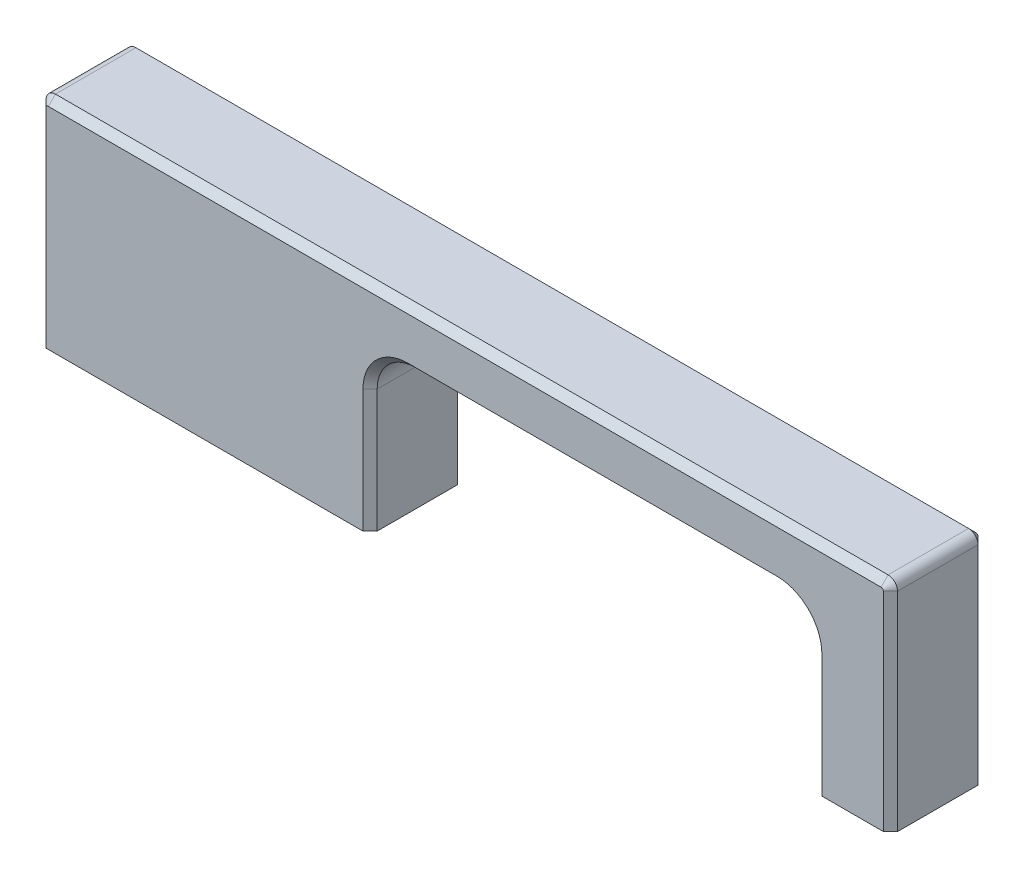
ISO-10303-21;
HEADER;
FILE_DESCRIPTION(('STEP AP214'),'2;1');
FILE_NAME('part.step','',(''),(''),'','','');
FILE_SCHEMA(('AUTOMOTIVE_DESIGN { 1 0 10303 214 1 1 1 1 }'));
ENDSEC;
DATA;
#1=APPLICATION_CONTEXT('core data for automotive mechanical design processes');
#2=APPLICATION_PROTOCOL_DEFINITION('international standard','automotive_design',2000,#1);
#3=PRODUCT_CONTEXT('',#1,'mechanical');
#4=PRODUCT('Part','Part','',(#3));
#5=PRODUCT_RELATED_PRODUCT_CATEGORY('part','',(#4));
#6=PRODUCT_DEFINITION_FORMATION('','',#4);
#7=PRODUCT_DEFINITION_CONTEXT('part definition',#1,'design');
#8=PRODUCT_DEFINITION('design','',#6,#7);
#9=PRODUCT_DEFINITION_SHAPE('','',#8);
#10=(LENGTH_UNIT() NAMED_UNIT(*) SI_UNIT(.MILLI.,.METRE.));
#11=(NAMED_UNIT(*) PLANE_ANGLE_UNIT() SI_UNIT($,.RADIAN.));
#12=(NAMED_UNIT(*) SI_UNIT($,.STERADIAN.) SOLID_ANGLE_UNIT());
#13=UNCERTAINTY_MEASURE_WITH_UNIT(LENGTH_MEASURE(1.E-05),#10,'distance_accuracy_value','');
#14=(GEOMETRIC_REPRESENTATION_CONTEXT(3) GLOBAL_UNCERTAINTY_ASSIGNED_CONTEXT((#13)) GLOBAL_UNIT_ASSIGNED_CONTEXT((#10,
#11,#12)) REPRESENTATION_CONTEXT('',''));
#15=CARTESIAN_POINT('',(0.,0.,0.));
#16=DIRECTION('',(0.,0.,1.));
#17=DIRECTION('',(1.,0.,0.));
#18=AXIS2_PLACEMENT_3D('',#15,#16,#17);
#19=CARTESIAN_POINT('',(45.,23.,5.));
#20=DIRECTION('',(-1.,0.,0.));
#21=DIRECTION('',(0.,-1.,0.));
#22=AXIS2_PLACEMENT_3D('',#19,#20,#21);
#23=PLANE('',#22);
#24=DIRECTION('',(0.,0.,-1.));
#25=VECTOR('',#24,1.);
#26=CARTESIAN_POINT('',(45.,0.,5.));
#27=LINE('',#26,#25);
#28=CARTESIAN_POINT('',(45.,0.,4.25));
#29=VERTEX_POINT('',#28);
#30=CARTESIAN_POINT('',(45.,0.,-4.25));
#31=VERTEX_POINT('',#30);
#32=EDGE_CURVE('E246',#29,#31,#27,.T.);
#33=ORIENTED_EDGE('',*,*,#32,.T.);
#34=DIRECTION('',(0.,1.,0.));
#35=VECTOR('',#34,1.);
#36=CARTESIAN_POINT('',(45.,22.,-4.25));
#37=LINE('',#36,#35);
#38=CARTESIAN_POINT('',(45.,22.,-4.25));
#39=VERTEX_POINT('',#38);
#40=EDGE_CURVE('E388',#31,#39,#37,.T.);
#41=ORIENTED_EDGE('',*,*,#40,.T.);
#42=DIRECTION('',(0.,0.,-1.));
#43=VECTOR('',#42,1.);
#44=CARTESIAN_POINT('',(45.,22.,5.));
#45=LINE('',#44,#43);
#46=CARTESIAN_POINT('',(45.,22.,4.25));
#47=VERTEX_POINT('',#46);
#48=EDGE_CURVE('E292',#39,#47,#45,.F.);
#49=ORIENTED_EDGE('',*,*,#48,.T.);
#50=DIRECTION('',(0.,-1.,0.));
#51=VECTOR('',#50,1.);
#52=CARTESIAN_POINT('',(45.,23.,4.25));
#53=LINE('',#52,#51);
#54=EDGE_CURVE('E385',#47,#29,#53,.T.);
#55=ORIENTED_EDGE('',*,*,#54,.T.);
#56=EDGE_LOOP('',(#33,#41,#49,#55));
#57=FACE_BOUND('',#56,.T.);
#58=ADVANCED_FACE('F43',(#57),#23,.F.);
#59=CARTESIAN_POINT('',(-45.,23.,5.));
#60=DIRECTION('',(0.,-1.,0.));
#61=DIRECTION('',(0.,0.,-1.));
#62=AXIS2_PLACEMENT_3D('',#59,#60,#61);
#63=PLANE('',#62);
#64=DIRECTION('',(0.,0.,-1.));
#65=VECTOR('',#64,1.);
#66=CARTESIAN_POINT('',(44.,23.,5.));
#67=LINE('',#66,#65);
#68=CARTESIAN_POINT('',(44.,23.,4.25));
#69=VERTEX_POINT('',#68);
#70=CARTESIAN_POINT('',(44.,23.,-4.25));
#71=VERTEX_POINT('',#70);
#72=EDGE_CURVE('E288',#69,#71,#67,.T.);
#73=ORIENTED_EDGE('',*,*,#72,.T.);
#74=DIRECTION('',(-1.,0.,0.));
#75=VECTOR('',#74,1.);
#76=CARTESIAN_POINT('',(-44.,23.,-4.25));
#77=LINE('',#76,#75);
#78=CARTESIAN_POINT('',(-44.,23.,-4.25));
#79=VERTEX_POINT('',#78);
#80=EDGE_CURVE('E401',#71,#79,#77,.T.);
#81=ORIENTED_EDGE('',*,*,#80,.T.);
#82=DIRECTION('',(0.,0.,-1.));
#83=VECTOR('',#82,1.);
#84=CARTESIAN_POINT('',(-44.,23.,5.));
#85=LINE('',#84,#83);
#86=CARTESIAN_POINT('',(-44.,23.,4.25));
#87=VERTEX_POINT('',#86);
#88=EDGE_CURVE('E284',#79,#87,#85,.F.);
#89=ORIENTED_EDGE('',*,*,#88,.T.);
#90=DIRECTION('',(1.,0.,0.));
#91=VECTOR('',#90,1.);
#92=CARTESIAN_POINT('',(-45.,23.,4.25));
#93=LINE('',#92,#91);
#94=EDGE_CURVE('E398',#87,#69,#93,.T.);
#95=ORIENTED_EDGE('',*,*,#94,.T.);
#96=EDGE_LOOP('',(#73,#81,#89,#95));
#97=FACE_BOUND('',#96,.T.);
#98=ADVANCED_FACE('F574',(#97),#63,.F.);
#99=CARTESIAN_POINT('',(-45.,0.,5.));
#100=DIRECTION('',(1.,0.,0.));
#101=DIRECTION('',(0.,1.,0.));
#102=AXIS2_PLACEMENT_3D('',#99,#100,#101);
#103=PLANE('',#102);
#104=DIRECTION('',(0.,0.,-1.));
#105=VECTOR('',#104,1.);
#106=CARTESIAN_POINT('',(-45.,22.,5.));
#107=LINE('',#106,#105);
#108=CARTESIAN_POINT('',(-45.,22.,4.25));
#109=VERTEX_POINT('',#108);
#110=CARTESIAN_POINT('',(-45.,22.,-4.25));
#111=VERTEX_POINT('',#110);
#112=EDGE_CURVE('E296',#109,#111,#107,.T.);
#113=ORIENTED_EDGE('',*,*,#112,.T.);
#114=DIRECTION('',(0.,-1.,0.));
#115=VECTOR('',#114,1.);
#116=CARTESIAN_POINT('',(-45.,0.,-4.25));
#117=LINE('',#116,#115);
#118=CARTESIAN_POINT('',(-45.,0.,-4.25));
#119=VERTEX_POINT('',#118);
#120=EDGE_CURVE('E413',#111,#119,#117,.T.);
#121=ORIENTED_EDGE('',*,*,#120,.T.);
#122=DIRECTION('',(0.,0.,-1.));
#123=VECTOR('',#122,1.);
#124=CARTESIAN_POINT('',(-45.,0.,5.));
#125=LINE('',#124,#123);
#126=CARTESIAN_POINT('',(-45.,0.,4.25));
#127=VERTEX_POINT('',#126);
#128=EDGE_CURVE('E264',#127,#119,#125,.T.);
#129=ORIENTED_EDGE('',*,*,#128,.F.);
#130=DIRECTION('',(0.,1.,0.));
#131=VECTOR('',#130,1.);
#132=CARTESIAN_POINT('',(-45.,0.,4.25));
#133=LINE('',#132,#131);
#134=EDGE_CURVE('E410',#127,#109,#133,.T.);
#135=ORIENTED_EDGE('',*,*,#134,.T.);
#136=EDGE_LOOP('',(#113,#121,#129,#135));
#137=FACE_BOUND('',#136,.T.);
#138=ADVANCED_FACE('F590',(#137),#103,.F.);
#139=CARTESIAN_POINT('',(-9.99999999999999,0.,5.));
#140=DIRECTION('',(0.,1.,0.));
#141=DIRECTION('',(-1.,0.,0.));
#142=AXIS2_PLACEMENT_3D('',#139,#140,#141);
#143=PLANE('',#142);
#144=CARTESIAN_POINT('',(-19.,0.,0.));
#145=DIRECTION('',(0.,-1.,0.));
#146=DIRECTION('',(0.,0.,-1.));
#147=AXIS2_PLACEMENT_3D('',#144,#145,#146);
#148=CIRCLE('',#147,1.64999999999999);
#149=CARTESIAN_POINT('',(-19.,0.,-1.64999999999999));
#150=VERTEX_POINT('',#149);
#151=EDGE_CURVE('E221',#150,#150,#148,.T.);
#152=ORIENTED_EDGE('',*,*,#151,.F.);
#153=EDGE_LOOP('',(#152));
#154=FACE_BOUND('',#153,.T.);
#155=DIRECTION('',(1.,0.,0.));
#156=VECTOR('',#155,1.);
#157=CARTESIAN_POINT('',(-9.99999999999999,0.,-5.));
#158=LINE('',#157,#156);
#159=CARTESIAN_POINT('',(-44.25,0.,-5.));
#160=VERTEX_POINT('',#159);
#161=CARTESIAN_POINT('',(-10.75,0.,-5.));
#162=VERTEX_POINT('',#161);
#163=EDGE_CURVE('E236',#160,#162,#158,.T.);
#164=ORIENTED_EDGE('',*,*,#163,.T.);
#165=DIRECTION('',(0.707106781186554,0.,0.707106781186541));
#166=VECTOR('',#165,1.);
#167=CARTESIAN_POINT('',(-10.,0.,-4.25));
#168=LINE('',#167,#166);
#169=CARTESIAN_POINT('',(-9.99999999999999,0.,-4.25));
#170=VERTEX_POINT('',#169);
#171=EDGE_CURVE('E382',#162,#170,#168,.T.);
#172=ORIENTED_EDGE('',*,*,#171,.T.);
#173=DIRECTION('',(0.,0.,-1.));
#174=VECTOR('',#173,1.);
#175=CARTESIAN_POINT('',(-9.99999999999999,0.,5.));
#176=LINE('',#175,#174);
#177=CARTESIAN_POINT('',(-9.99999999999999,0.,4.25));
#178=VERTEX_POINT('',#177);
#179=EDGE_CURVE('E260',#178,#170,#176,.T.);
#180=ORIENTED_EDGE('',*,*,#179,.F.);
#181=DIRECTION('',(0.707106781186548,0.,-0.707106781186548));
#182=VECTOR('',#181,1.);
#183=CARTESIAN_POINT('',(-10.75,0.,5.));
#184=LINE('',#183,#182);
#185=CARTESIAN_POINT('',(-10.75,0.,5.));
#186=VERTEX_POINT('',#185);
#187=EDGE_CURVE('E376',#178,#186,#184,.F.);
#188=ORIENTED_EDGE('',*,*,#187,.T.);
#189=DIRECTION('',(1.,0.,0.));
#190=VECTOR('',#189,1.);
#191=CARTESIAN_POINT('',(-9.99999999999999,0.,5.));
#192=LINE('',#191,#190);
#193=CARTESIAN_POINT('',(-44.25,0.,5.));
#194=VERTEX_POINT('',#193);
#195=EDGE_CURVE('E237',#194,#186,#192,.T.);
#196=ORIENTED_EDGE('',*,*,#195,.F.);
#197=DIRECTION('',(0.707106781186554,0.,0.707106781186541));
#198=VECTOR('',#197,1.);
#199=CARTESIAN_POINT('',(-44.25,0.,5.));
#200=LINE('',#199,#198);
#201=EDGE_CURVE('E373',#194,#127,#200,.F.);
#202=ORIENTED_EDGE('',*,*,#201,.T.);
#203=ORIENTED_EDGE('',*,*,#128,.T.);
#204=DIRECTION('',(0.707106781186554,0.,-0.707106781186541));
#205=VECTOR('',#204,1.);
#206=CARTESIAN_POINT('',(-45.,0.,-4.25));
#207=LINE('',#206,#205);
#208=EDGE_CURVE('E379',#119,#160,#207,.T.);
#209=ORIENTED_EDGE('',*,*,#208,.T.);
#210=EDGE_LOOP('',(#164,#172,#180,#188,#196,#202,#203,#209));
#211=FACE_BOUND('',#210,.T.);
#212=ADVANCED_FACE('F516',(#154,#211),#143,.F.);
#213=CARTESIAN_POINT('',(-10.,17.,5.));
#214=DIRECTION('',(-1.,0.,0.));
#215=DIRECTION('',(0.,-1.,0.));
#216=AXIS2_PLACEMENT_3D('',#213,#214,#215);
#217=PLANE('',#216);
#218=ORIENTED_EDGE('',*,*,#179,.T.);
#219=DIRECTION('',(0.,1.,0.));
#220=VECTOR('',#219,1.);
#221=CARTESIAN_POINT('',(-10.,13.,-4.25));
#222=LINE('',#221,#220);
#223=CARTESIAN_POINT('',(-10.,13.,-4.25));
#224=VERTEX_POINT('',#223);
#225=EDGE_CURVE('E370',#170,#224,#222,.T.);
#226=ORIENTED_EDGE('',*,*,#225,.T.);
#227=DIRECTION('',(0.,0.,-1.));
#228=VECTOR('',#227,1.);
#229=CARTESIAN_POINT('',(-10.,13.,5.));
#230=LINE('',#229,#228);
#231=CARTESIAN_POINT('',(-10.,13.,4.25));
#232=VERTEX_POINT('',#231);
#233=EDGE_CURVE('E280',#224,#232,#230,.F.);
#234=ORIENTED_EDGE('',*,*,#233,.T.);
#235=DIRECTION('',(0.,-1.,0.));
#236=VECTOR('',#235,1.);
#237=CARTESIAN_POINT('',(-10.,17.,4.25));
#238=LINE('',#237,#236);
#239=EDGE_CURVE('E367',#232,#178,#238,.T.);
#240=ORIENTED_EDGE('',*,*,#239,.T.);
#241=EDGE_LOOP('',(#218,#226,#234,#240));
#242=FACE_BOUND('',#241,.T.);
#243=ADVANCED_FACE('F644',(#242),#217,.F.);
#244=CARTESIAN_POINT('',(37.,17.,5.));
#245=DIRECTION('',(0.,1.,0.));
#246=DIRECTION('',(-1.,0.,0.));
#247=AXIS2_PLACEMENT_3D('',#244,#245,#246);
#248=PLANE('',#247);
#249=DIRECTION('',(0.,0.,-1.));
#250=VECTOR('',#249,1.);
#251=CARTESIAN_POINT('',(-6.,17.,-5.));
#252=LINE('',#251,#250);
#253=CARTESIAN_POINT('',(-6.,17.,4.25));
#254=VERTEX_POINT('',#253);
#255=CARTESIAN_POINT('',(-6.,17.,-4.25));
#256=VERTEX_POINT('',#255);
#257=EDGE_CURVE('E272',#254,#256,#252,.T.);
#258=ORIENTED_EDGE('',*,*,#257,.T.);
#259=DIRECTION('',(1.,0.,0.));
#260=VECTOR('',#259,1.);
#261=CARTESIAN_POINT('',(33.,17.,-4.25));
#262=LINE('',#261,#260);
#263=CARTESIAN_POINT('',(33.,17.,-4.25));
#264=VERTEX_POINT('',#263);
#265=EDGE_CURVE('E358',#256,#264,#262,.T.);
#266=ORIENTED_EDGE('',*,*,#265,.T.);
#267=DIRECTION('',(0.,0.,-1.));
#268=VECTOR('',#267,1.);
#269=CARTESIAN_POINT('',(33.,17.,5.));
#270=LINE('',#269,#268);
#271=CARTESIAN_POINT('',(33.,17.,4.25));
#272=VERTEX_POINT('',#271);
#273=EDGE_CURVE('E276',#264,#272,#270,.F.);
#274=ORIENTED_EDGE('',*,*,#273,.T.);
#275=DIRECTION('',(-1.,0.,0.));
#276=VECTOR('',#275,1.);
#277=CARTESIAN_POINT('',(37.,17.,4.25));
#278=LINE('',#277,#276);
#279=EDGE_CURVE('E355',#272,#254,#278,.T.);
#280=ORIENTED_EDGE('',*,*,#279,.T.);
#281=EDGE_LOOP('',(#258,#266,#274,#280));
#282=FACE_BOUND('',#281,.T.);
#283=ADVANCED_FACE('F616',(#282),#248,.F.);
#284=CARTESIAN_POINT('',(37.,0.,5.));
#285=DIRECTION('',(1.,0.,0.));
#286=DIRECTION('',(0.,0.,-1.));
#287=AXIS2_PLACEMENT_3D('',#284,#285,#286);
#288=PLANE('',#287);
#289=DIRECTION('',(0.,0.,-1.));
#290=VECTOR('',#289,1.);
#291=CARTESIAN_POINT('',(37.,13.,-5.));
#292=LINE('',#291,#290);
#293=CARTESIAN_POINT('',(37.,13.,4.25));
#294=VERTEX_POINT('',#293);
#295=CARTESIAN_POINT('',(37.,13.,-4.25));
#296=VERTEX_POINT('',#295);
#297=EDGE_CURVE('E268',#294,#296,#292,.T.);
#298=ORIENTED_EDGE('',*,*,#297,.T.);
#299=DIRECTION('',(0.,-1.,0.));
#300=VECTOR('',#299,1.);
#301=CARTESIAN_POINT('',(37.,0.,-4.25));
#302=LINE('',#301,#300);
#303=CARTESIAN_POINT('',(37.,0.,-4.25));
#304=VERTEX_POINT('',#303);
#305=EDGE_CURVE('E303',#296,#304,#302,.T.);
#306=ORIENTED_EDGE('',*,*,#305,.T.);
#307=DIRECTION('',(0.,0.,-1.));
#308=VECTOR('',#307,1.);
#309=CARTESIAN_POINT('',(37.,0.,5.));
#310=LINE('',#309,#308);
#311=CARTESIAN_POINT('',(37.,0.,4.25));
#312=VERTEX_POINT('',#311);
#313=EDGE_CURVE('E256',#312,#304,#310,.T.);
#314=ORIENTED_EDGE('',*,*,#313,.F.);
#315=DIRECTION('',(0.,1.,0.));
#316=VECTOR('',#315,1.);
#317=CARTESIAN_POINT('',(37.,0.,4.25));
#318=LINE('',#317,#316);
#319=EDGE_CURVE('E300',#312,#294,#318,.T.);
#320=ORIENTED_EDGE('',*,*,#319,.T.);
#321=EDGE_LOOP('',(#298,#306,#314,#320));
#322=FACE_BOUND('',#321,.T.);
#323=ADVANCED_FACE('F635',(#322),#288,.F.);
#324=CARTESIAN_POINT('',(45.,0.,5.));
#325=DIRECTION('',(0.,1.,0.));
#326=DIRECTION('',(-1.,0.,0.));
#327=AXIS2_PLACEMENT_3D('',#324,#325,#326);
#328=PLANE('',#327);
#329=CARTESIAN_POINT('',(41.,0.,0.));
#330=DIRECTION('',(0.,-1.,0.));
#331=DIRECTION('',(0.,0.,-1.));
#332=AXIS2_PLACEMENT_3D('',#329,#330,#331);
#333=CIRCLE('',#332,1.64999999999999);
#334=CARTESIAN_POINT('',(41.,0.,-1.64999999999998));
#335=VERTEX_POINT('',#334);
#336=EDGE_CURVE('E222',#335,#335,#333,.T.);
#337=ORIENTED_EDGE('',*,*,#336,.F.);
#338=EDGE_LOOP('',(#337));
#339=FACE_BOUND('',#338,.T.);
#340=ORIENTED_EDGE('',*,*,#313,.T.);
#341=DIRECTION('',(0.707106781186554,0.,-0.707106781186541));
#342=VECTOR('',#341,1.);
#343=CARTESIAN_POINT('',(37.,0.,-4.25));
#344=LINE('',#343,#342);
#345=CARTESIAN_POINT('',(37.75,0.,-5.));
#346=VERTEX_POINT('',#345);
#347=EDGE_CURVE('E316',#304,#346,#344,.T.);
#348=ORIENTED_EDGE('',*,*,#347,.T.);
#349=DIRECTION('',(1.,0.,0.));
#350=VECTOR('',#349,1.);
#351=CARTESIAN_POINT('',(45.,0.,-5.));
#352=LINE('',#351,#350);
#353=CARTESIAN_POINT('',(44.25,0.,-5.));
#354=VERTEX_POINT('',#353);
#355=EDGE_CURVE('E242',#346,#354,#352,.T.);
#356=ORIENTED_EDGE('',*,*,#355,.T.);
#357=DIRECTION('',(0.707106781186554,0.,0.707106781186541));
#358=VECTOR('',#357,1.);
#359=CARTESIAN_POINT('',(45.,0.,-4.25));
#360=LINE('',#359,#358);
#361=EDGE_CURVE('E313',#354,#31,#360,.T.);
#362=ORIENTED_EDGE('',*,*,#361,.T.);
#363=ORIENTED_EDGE('',*,*,#32,.F.);
#364=DIRECTION('',(0.707106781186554,0.,-0.707106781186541));
#365=VECTOR('',#364,1.);
#366=CARTESIAN_POINT('',(44.25,0.,5.));
#367=LINE('',#366,#365);
#368=CARTESIAN_POINT('',(44.25,0.,5.));
#369=VERTEX_POINT('',#368);
#370=EDGE_CURVE('E307',#29,#369,#367,.F.);
#371=ORIENTED_EDGE('',*,*,#370,.T.);
#372=DIRECTION('',(1.,0.,0.));
#373=VECTOR('',#372,1.);
#374=CARTESIAN_POINT('',(45.,0.,5.));
#375=LINE('',#374,#373);
#376=CARTESIAN_POINT('',(37.75,0.,5.));
#377=VERTEX_POINT('',#376);
#378=EDGE_CURVE('E241',#377,#369,#375,.T.);
#379=ORIENTED_EDGE('',*,*,#378,.F.);
#380=DIRECTION('',(0.707106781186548,0.,0.707106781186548));
#381=VECTOR('',#380,1.);
#382=CARTESIAN_POINT('',(37.75,0.,5.));
#383=LINE('',#382,#381);
#384=EDGE_CURVE('E310',#377,#312,#383,.F.);
#385=ORIENTED_EDGE('',*,*,#384,.T.);
#386=EDGE_LOOP('',(#340,#348,#356,#362,#363,#371,#379,#385));
#387=FACE_BOUND('',#386,.T.);
#388=ADVANCED_FACE('F542',(#339,#387),#328,.F.);
#389=CARTESIAN_POINT('',(0.,0.,5.));
#390=DIRECTION('',(0.,0.,-1.));
#391=DIRECTION('',(-1.,0.,0.));
#392=AXIS2_PLACEMENT_3D('',#389,#390,#391);
#393=PLANE('',#392);
#394=CARTESIAN_POINT('',(33.,13.,5.));
#395=DIRECTION('',(0.,0.,-1.));
#396=DIRECTION('',(-1.,0.,0.));
#397=AXIS2_PLACEMENT_3D('',#394,#395,#396);
#398=CIRCLE('',#397,4.75);
#399=CARTESIAN_POINT('',(33.,17.75,5.));
#400=VERTEX_POINT('',#399);
#401=CARTESIAN_POINT('',(37.75,13.,5.));
#402=VERTEX_POINT('',#401);
#403=EDGE_CURVE('E54',#400,#402,#398,.T.);
#404=ORIENTED_EDGE('',*,*,#403,.T.);
#405=DIRECTION('',(0.,-1.,0.));
#406=VECTOR('',#405,1.);
#407=CARTESIAN_POINT('',(37.75,0.,5.));
#408=LINE('',#407,#406);
#409=EDGE_CURVE('E11',#402,#377,#408,.T.);
#410=ORIENTED_EDGE('',*,*,#409,.T.);
#411=ORIENTED_EDGE('',*,*,#378,.T.);
#412=DIRECTION('',(0.,1.,0.));
#413=VECTOR('',#412,1.);
#414=CARTESIAN_POINT('',(44.25,0.,5.));
#415=LINE('',#414,#413);
#416=CARTESIAN_POINT('',(44.25,22.,5.));
#417=VERTEX_POINT('',#416);
#418=EDGE_CURVE('E428',#369,#417,#415,.T.);
#419=ORIENTED_EDGE('',*,*,#418,.T.);
#420=CARTESIAN_POINT('',(44.,22.,5.));
#421=DIRECTION('',(0.,0.,-1.));
#422=DIRECTION('',(-1.,0.,0.));
#423=AXIS2_PLACEMENT_3D('',#420,#421,#422);
#424=CIRCLE('',#423,0.249999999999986);
#425=CARTESIAN_POINT('',(44.,22.25,5.));
#426=VERTEX_POINT('',#425);
#427=EDGE_CURVE('E425',#417,#426,#424,.F.);
#428=ORIENTED_EDGE('',*,*,#427,.T.);
#429=DIRECTION('',(-1.,0.,0.));
#430=VECTOR('',#429,1.);
#431=CARTESIAN_POINT('',(0.,22.25,5.));
#432=LINE('',#431,#430);
#433=CARTESIAN_POINT('',(-44.,22.25,5.));
#434=VERTEX_POINT('',#433);
#435=EDGE_CURVE('E422',#426,#434,#432,.T.);
#436=ORIENTED_EDGE('',*,*,#435,.T.);
#437=CARTESIAN_POINT('',(-44.,22.,5.));
#438=DIRECTION('',(0.,0.,-1.));
#439=DIRECTION('',(-1.,0.,0.));
#440=AXIS2_PLACEMENT_3D('',#437,#438,#439);
#441=CIRCLE('',#440,0.249999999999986);
#442=CARTESIAN_POINT('',(-44.25,22.,5.));
#443=VERTEX_POINT('',#442);
#444=EDGE_CURVE('E419',#434,#443,#441,.F.);
#445=ORIENTED_EDGE('',*,*,#444,.T.);
#446=DIRECTION('',(0.,-1.,0.));
#447=VECTOR('',#446,1.);
#448=CARTESIAN_POINT('',(-44.25,0.,5.));
#449=LINE('',#448,#447);
#450=EDGE_CURVE('E416',#443,#194,#449,.T.);
#451=ORIENTED_EDGE('',*,*,#450,.T.);
#452=ORIENTED_EDGE('',*,*,#195,.T.);
#453=DIRECTION('',(0.,1.,0.));
#454=VECTOR('',#453,1.);
#455=CARTESIAN_POINT('',(-10.75,0.,5.));
#456=LINE('',#455,#454);
#457=CARTESIAN_POINT('',(-10.75,13.,5.));
#458=VERTEX_POINT('',#457);
#459=EDGE_CURVE('E432',#186,#458,#456,.T.);
#460=ORIENTED_EDGE('',*,*,#459,.T.);
#461=CARTESIAN_POINT('',(-6.,13.,5.));
#462=DIRECTION('',(0.,0.,-1.));
#463=DIRECTION('',(-1.,0.,0.));
#464=AXIS2_PLACEMENT_3D('',#461,#462,#463);
#465=CIRCLE('',#464,4.75);
#466=CARTESIAN_POINT('',(-6.,17.75,5.));
#467=VERTEX_POINT('',#466);
#468=EDGE_CURVE('E435',#458,#467,#465,.T.);
#469=ORIENTED_EDGE('',*,*,#468,.T.);
#470=DIRECTION('',(1.,0.,0.));
#471=VECTOR('',#470,1.);
#472=CARTESIAN_POINT('',(0.,17.75,5.));
#473=LINE('',#472,#471);
#474=EDGE_CURVE('E65',#467,#400,#473,.T.);
#475=ORIENTED_EDGE('',*,*,#474,.T.);
#476=EDGE_LOOP('',(#404,#410,#411,#419,#428,#436,#445,#451,#452,#460,#469,#475));
#477=FACE_BOUND('',#476,.T.);
#478=ADVANCED_FACE('F513',(#477),#393,.F.);
#479=CARTESIAN_POINT('',(0.,0.,-5.));
#480=DIRECTION('',(0.,0.,-1.));
#481=DIRECTION('',(-1.,0.,0.));
#482=AXIS2_PLACEMENT_3D('',#479,#480,#481);
#483=PLANE('',#482);
#484=ORIENTED_EDGE('',*,*,#355,.F.);
#485=DIRECTION('',(0.,1.,0.));
#486=VECTOR('',#485,1.);
#487=CARTESIAN_POINT('',(37.75,13.,-5.));
#488=LINE('',#487,#486);
#489=CARTESIAN_POINT('',(37.75,13.,-5.));
#490=VERTEX_POINT('',#489);
#491=EDGE_CURVE('E346',#346,#490,#488,.T.);
#492=ORIENTED_EDGE('',*,*,#491,.T.);
#493=CARTESIAN_POINT('',(33.,13.,-5.));
#494=DIRECTION('',(0.,0.,-1.));
#495=DIRECTION('',(-1.,0.,0.));
#496=AXIS2_PLACEMENT_3D('',#493,#494,#495);
#497=CIRCLE('',#496,4.75000000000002);
#498=CARTESIAN_POINT('',(33.,17.75,-5.));
#499=VERTEX_POINT('',#498);
#500=EDGE_CURVE('E343',#490,#499,#497,.F.);
#501=ORIENTED_EDGE('',*,*,#500,.T.);
#502=DIRECTION('',(-1.,0.,0.));
#503=VECTOR('',#502,1.);
#504=CARTESIAN_POINT('',(-6.,17.75,-5.));
#505=LINE('',#504,#503);
#506=CARTESIAN_POINT('',(-6.,17.75,-5.));
#507=VERTEX_POINT('',#506);
#508=EDGE_CURVE('E340',#499,#507,#505,.T.);
#509=ORIENTED_EDGE('',*,*,#508,.T.);
#510=CARTESIAN_POINT('',(-6.,13.,-5.));
#511=DIRECTION('',(0.,0.,-1.));
#512=DIRECTION('',(-1.,0.,0.));
#513=AXIS2_PLACEMENT_3D('',#510,#511,#512);
#514=CIRCLE('',#513,4.75000000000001);
#515=CARTESIAN_POINT('',(-10.75,13.,-5.));
#516=VERTEX_POINT('',#515);
#517=EDGE_CURVE('E337',#507,#516,#514,.F.);
#518=ORIENTED_EDGE('',*,*,#517,.T.);
#519=DIRECTION('',(0.,-1.,0.));
#520=VECTOR('',#519,1.);
#521=CARTESIAN_POINT('',(-10.75,0.,-5.));
#522=LINE('',#521,#520);
#523=EDGE_CURVE('E334',#516,#162,#522,.T.);
#524=ORIENTED_EDGE('',*,*,#523,.T.);
#525=ORIENTED_EDGE('',*,*,#163,.F.);
#526=DIRECTION('',(0.,1.,0.));
#527=VECTOR('',#526,1.);
#528=CARTESIAN_POINT('',(-44.25,22.,-5.));
#529=LINE('',#528,#527);
#530=CARTESIAN_POINT('',(-44.25,22.,-5.));
#531=VERTEX_POINT('',#530);
#532=EDGE_CURVE('E319',#160,#531,#529,.T.);
#533=ORIENTED_EDGE('',*,*,#532,.T.);
#534=CARTESIAN_POINT('',(-44.,22.,-5.));
#535=DIRECTION('',(0.,0.,-1.));
#536=DIRECTION('',(-1.,0.,0.));
#537=AXIS2_PLACEMENT_3D('',#534,#535,#536);
#538=CIRCLE('',#537,0.249999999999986);
#539=CARTESIAN_POINT('',(-44.,22.25,-5.));
#540=VERTEX_POINT('',#539);
#541=EDGE_CURVE('E322',#531,#540,#538,.T.);
#542=ORIENTED_EDGE('',*,*,#541,.T.);
#543=DIRECTION('',(1.,0.,0.));
#544=VECTOR('',#543,1.);
#545=CARTESIAN_POINT('',(44.,22.25,-5.));
#546=LINE('',#545,#544);
#547=CARTESIAN_POINT('',(44.,22.25,-5.));
#548=VERTEX_POINT('',#547);
#549=EDGE_CURVE('E325',#540,#548,#546,.T.);
#550=ORIENTED_EDGE('',*,*,#549,.T.);
#551=CARTESIAN_POINT('',(44.,22.,-5.));
#552=DIRECTION('',(0.,0.,-1.));
#553=DIRECTION('',(-1.,0.,0.));
#554=AXIS2_PLACEMENT_3D('',#551,#552,#553);
#555=CIRCLE('',#554,0.249999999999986);
#556=CARTESIAN_POINT('',(44.25,22.,-5.));
#557=VERTEX_POINT('',#556);
#558=EDGE_CURVE('E328',#548,#557,#555,.T.);
#559=ORIENTED_EDGE('',*,*,#558,.T.);
#560=DIRECTION('',(0.,-1.,0.));
#561=VECTOR('',#560,1.);
#562=CARTESIAN_POINT('',(44.25,0.,-5.));
#563=LINE('',#562,#561);
#564=EDGE_CURVE('E331',#557,#354,#563,.T.);
#565=ORIENTED_EDGE('',*,*,#564,.T.);
#566=EDGE_LOOP('',(#484,#492,#501,#509,#518,#524,#525,#533,#542,#550,#559,#565));
#567=FACE_BOUND('',#566,.T.);
#568=ADVANCED_FACE('F599',(#567),#483,.T.);
#569=CARTESIAN_POINT('',(-19.,11.5,0.));
#570=DIRECTION('',(0.,-1.,0.));
#571=DIRECTION('',(0.,0.,-1.));
#572=AXIS2_PLACEMENT_3D('',#569,#570,#571);
#573=CONICAL_SURFACE('',#572,1.65,1.02974425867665);
#574=CARTESIAN_POINT('',(-19.,12.4914200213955,0.));
#575=VERTEX_POINT('',#574);
#576=VERTEX_LOOP('',#575);
#577=FACE_BOUND('',#576,.T.);
#578=CARTESIAN_POINT('',(-19.,11.5,0.));
#579=DIRECTION('',(0.,-1.,0.));
#580=DIRECTION('',(0.,0.,-1.));
#581=AXIS2_PLACEMENT_3D('',#578,#579,#580);
#582=CIRCLE('',#581,1.65);
#583=CARTESIAN_POINT('',(-19.,11.5,-1.65));
#584=VERTEX_POINT('',#583);
#585=EDGE_CURVE('E227',#584,#584,#582,.T.);
#586=ORIENTED_EDGE('',*,*,#585,.T.);
#587=EDGE_LOOP('',(#586));
#588=FACE_BOUND('',#587,.T.);
#589=ADVANCED_FACE('F854',(#577,#588),#573,.F.);
#590=CARTESIAN_POINT('',(-19.,0.,0.));
#591=DIRECTION('',(0.,-1.,0.));
#592=DIRECTION('',(0.,0.,-1.));
#593=AXIS2_PLACEMENT_3D('',#590,#591,#592);
#594=CYLINDRICAL_SURFACE('',#593,1.65);
#595=ORIENTED_EDGE('',*,*,#585,.F.);
#596=EDGE_LOOP('',(#595));
#597=FACE_BOUND('',#596,.T.);
#598=ORIENTED_EDGE('',*,*,#151,.T.);
#599=EDGE_LOOP('',(#598));
#600=FACE_BOUND('',#599,.T.);
#601=ADVANCED_FACE('F214',(#597,#600),#594,.F.);
#602=CARTESIAN_POINT('',(41.,11.5,0.));
#603=DIRECTION('',(0.,-1.,0.));
#604=DIRECTION('',(0.,0.,-1.));
#605=AXIS2_PLACEMENT_3D('',#602,#603,#604);
#606=CONICAL_SURFACE('',#605,1.65,1.02974425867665);
#607=CARTESIAN_POINT('',(41.,12.4914200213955,0.));
#608=VERTEX_POINT('',#607);
#609=VERTEX_LOOP('',#608);
#610=FACE_BOUND('',#609,.T.);
#611=CARTESIAN_POINT('',(41.,11.5,0.));
#612=DIRECTION('',(0.,-1.,0.));
#613=DIRECTION('',(0.,0.,-1.));
#614=AXIS2_PLACEMENT_3D('',#611,#612,#613);
#615=CIRCLE('',#614,1.65);
#616=CARTESIAN_POINT('',(41.,11.5,-1.64999999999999));
#617=VERTEX_POINT('',#616);
#618=EDGE_CURVE('E218',#617,#617,#615,.T.);
#619=ORIENTED_EDGE('',*,*,#618,.T.);
#620=EDGE_LOOP('',(#619));
#621=FACE_BOUND('',#620,.T.);
#622=ADVANCED_FACE('F210',(#610,#621),#606,.F.);
#623=CARTESIAN_POINT('',(41.,0.,0.));
#624=DIRECTION('',(0.,-1.,0.));
#625=DIRECTION('',(0.,0.,-1.));
#626=AXIS2_PLACEMENT_3D('',#623,#624,#625);
#627=CYLINDRICAL_SURFACE('',#626,1.65);
#628=ORIENTED_EDGE('',*,*,#618,.F.);
#629=EDGE_LOOP('',(#628));
#630=FACE_BOUND('',#629,.T.);
#631=ORIENTED_EDGE('',*,*,#336,.T.);
#632=EDGE_LOOP('',(#631));
#633=FACE_BOUND('',#632,.T.);
#634=ADVANCED_FACE('F213',(#630,#633),#627,.F.);
#635=CARTESIAN_POINT('',(33.,13.,5.));
#636=DIRECTION('',(0.,0.,1.));
#637=DIRECTION('',(1.,0.,0.));
#638=AXIS2_PLACEMENT_3D('',#635,#636,#637);
#639=CYLINDRICAL_SURFACE('',#638,4.);
#640=ORIENTED_EDGE('',*,*,#273,.F.);
#641=CARTESIAN_POINT('',(33.,13.,-4.25));
#642=DIRECTION('',(0.,0.,-1.));
#643=DIRECTION('',(-1.,0.,0.));
#644=AXIS2_PLACEMENT_3D('',#641,#642,#643);
#645=CIRCLE('',#644,4.);
#646=EDGE_CURVE('E352',#264,#296,#645,.T.);
#647=ORIENTED_EDGE('',*,*,#646,.T.);
#648=ORIENTED_EDGE('',*,*,#297,.F.);
#649=CARTESIAN_POINT('',(33.,13.,4.25));
#650=DIRECTION('',(0.,0.,-1.));
#651=DIRECTION('',(-1.,0.,0.));
#652=AXIS2_PLACEMENT_3D('',#649,#650,#651);
#653=CIRCLE('',#652,4.);
#654=EDGE_CURVE('E349',#294,#272,#653,.F.);
#655=ORIENTED_EDGE('',*,*,#654,.T.);
#656=EDGE_LOOP('',(#640,#647,#648,#655));
#657=FACE_BOUND('',#656,.T.);
#658=ADVANCED_FACE('F620',(#657),#639,.F.);
#659=CARTESIAN_POINT('',(-6.,13.,5.));
#660=DIRECTION('',(0.,0.,1.));
#661=DIRECTION('',(1.,0.,0.));
#662=AXIS2_PLACEMENT_3D('',#659,#660,#661);
#663=CYLINDRICAL_SURFACE('',#662,4.);
#664=ORIENTED_EDGE('',*,*,#233,.F.);
#665=CARTESIAN_POINT('',(-6.,13.,-4.25));
#666=DIRECTION('',(0.,0.,-1.));
#667=DIRECTION('',(-1.,0.,0.));
#668=AXIS2_PLACEMENT_3D('',#665,#666,#667);
#669=CIRCLE('',#668,4.);
#670=EDGE_CURVE('E364',#224,#256,#669,.T.);
#671=ORIENTED_EDGE('',*,*,#670,.T.);
#672=ORIENTED_EDGE('',*,*,#257,.F.);
#673=CARTESIAN_POINT('',(-6.,13.,4.25));
#674=DIRECTION('',(0.,0.,-1.));
#675=DIRECTION('',(-1.,0.,0.));
#676=AXIS2_PLACEMENT_3D('',#673,#674,#675);
#677=CIRCLE('',#676,4.);
#678=EDGE_CURVE('E361',#254,#232,#677,.F.);
#679=ORIENTED_EDGE('',*,*,#678,.T.);
#680=EDGE_LOOP('',(#664,#671,#672,#679));
#681=FACE_BOUND('',#680,.T.);
#682=ADVANCED_FACE('F614',(#681),#663,.F.);
#683=CARTESIAN_POINT('',(44.,22.,5.));
#684=DIRECTION('',(0.,0.,-1.));
#685=DIRECTION('',(-1.,0.,0.));
#686=AXIS2_PLACEMENT_3D('',#683,#684,#685);
#687=CYLINDRICAL_SURFACE('',#686,1.);
#688=ORIENTED_EDGE('',*,*,#48,.F.);
#689=CARTESIAN_POINT('',(44.,22.,-4.25));
#690=DIRECTION('',(0.,0.,-1.));
#691=DIRECTION('',(-1.,0.,0.));
#692=AXIS2_PLACEMENT_3D('',#689,#690,#691);
#693=CIRCLE('',#692,1.);
#694=EDGE_CURVE('E395',#39,#71,#693,.F.);
#695=ORIENTED_EDGE('',*,*,#694,.T.);
#696=ORIENTED_EDGE('',*,*,#72,.F.);
#697=CARTESIAN_POINT('',(44.,22.,4.25));
#698=DIRECTION('',(0.,0.,-1.));
#699=DIRECTION('',(-1.,0.,0.));
#700=AXIS2_PLACEMENT_3D('',#697,#698,#699);
#701=CIRCLE('',#700,1.);
#702=EDGE_CURVE('E392',#69,#47,#701,.T.);
#703=ORIENTED_EDGE('',*,*,#702,.T.);
#704=EDGE_LOOP('',(#688,#695,#696,#703));
#705=FACE_BOUND('',#704,.T.);
#706=ADVANCED_FACE('F559',(#705),#687,.T.);
#707=CARTESIAN_POINT('',(-44.,22.,5.));
#708=DIRECTION('',(0.,0.,-1.));
#709=DIRECTION('',(-1.,0.,0.));
#710=AXIS2_PLACEMENT_3D('',#707,#708,#709);
#711=CYLINDRICAL_SURFACE('',#710,1.);
#712=ORIENTED_EDGE('',*,*,#88,.F.);
#713=CARTESIAN_POINT('',(-44.,22.,-4.25));
#714=DIRECTION('',(0.,0.,-1.));
#715=DIRECTION('',(-1.,0.,0.));
#716=AXIS2_PLACEMENT_3D('',#713,#714,#715);
#717=CIRCLE('',#716,1.);
#718=EDGE_CURVE('E407',#79,#111,#717,.F.);
#719=ORIENTED_EDGE('',*,*,#718,.T.);
#720=ORIENTED_EDGE('',*,*,#112,.F.);
#721=CARTESIAN_POINT('',(-44.,22.,4.25));
#722=DIRECTION('',(0.,0.,-1.));
#723=DIRECTION('',(-1.,0.,0.));
#724=AXIS2_PLACEMENT_3D('',#721,#722,#723);
#725=CIRCLE('',#724,1.);
#726=EDGE_CURVE('E404',#109,#87,#725,.T.);
#727=ORIENTED_EDGE('',*,*,#726,.T.);
#728=EDGE_LOOP('',(#712,#719,#720,#727));
#729=FACE_BOUND('',#728,.T.);
#730=ADVANCED_FACE('F587',(#729),#711,.T.);
#731=CARTESIAN_POINT('',(-10.,17.,-4.25));
#732=DIRECTION('',(0.707106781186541,0.,-0.707106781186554));
#733=DIRECTION('',(0.,-1.,0.));
#734=AXIS2_PLACEMENT_3D('',#731,#732,#733);
#735=PLANE('',#734);
#736=ORIENTED_EDGE('',*,*,#171,.F.);
#737=ORIENTED_EDGE('',*,*,#523,.F.);
#738=DIRECTION('',(-0.707106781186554,0.,-0.707106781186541));
#739=VECTOR('',#738,1.);
#740=CARTESIAN_POINT('',(-10.,13.,-4.25));
#741=LINE('',#740,#739);
#742=EDGE_CURVE('E230',#224,#516,#741,.T.);
#743=ORIENTED_EDGE('',*,*,#742,.F.);
#744=ORIENTED_EDGE('',*,*,#225,.F.);
#745=EDGE_LOOP('',(#736,#737,#743,#744));
#746=FACE_BOUND('',#745,.T.);
#747=ADVANCED_FACE('F604',(#746),#735,.T.);
#748=CARTESIAN_POINT('',(-6.,13.,-5.));
#749=DIRECTION('',(0.,0.,-1.));
#750=DIRECTION('',(-1.,0.,0.));
#751=AXIS2_PLACEMENT_3D('',#748,#749,#750);
#752=CONICAL_SURFACE('',#751,4.75000000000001,0.785398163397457);
#753=ORIENTED_EDGE('',*,*,#742,.T.);
#754=ORIENTED_EDGE('',*,*,#517,.F.);
#755=DIRECTION('',(0.,0.707106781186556,-0.707106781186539));
#756=VECTOR('',#755,1.);
#757=CARTESIAN_POINT('',(-6.,17.,-4.25));
#758=LINE('',#757,#756);
#759=EDGE_CURVE('E451',#256,#507,#758,.T.);
#760=ORIENTED_EDGE('',*,*,#759,.F.);
#761=ORIENTED_EDGE('',*,*,#670,.F.);
#762=EDGE_LOOP('',(#753,#754,#760,#761));
#763=FACE_BOUND('',#762,.T.);
#764=ADVANCED_FACE('F608',(#763),#752,.F.);
#765=CARTESIAN_POINT('',(37.,17.,-4.25));
#766=DIRECTION('',(0.,-0.70710678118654,-0.707106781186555));
#767=DIRECTION('',(-1.,0.,0.));
#768=AXIS2_PLACEMENT_3D('',#765,#766,#767);
#769=PLANE('',#768);
#770=ORIENTED_EDGE('',*,*,#759,.T.);
#771=ORIENTED_EDGE('',*,*,#508,.F.);
#772=DIRECTION('',(0.,0.707106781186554,-0.707106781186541));
#773=VECTOR('',#772,1.);
#774=CARTESIAN_POINT('',(33.,17.,-4.25));
#775=LINE('',#774,#773);
#776=EDGE_CURVE('E446',#264,#499,#775,.T.);
#777=ORIENTED_EDGE('',*,*,#776,.F.);
#778=ORIENTED_EDGE('',*,*,#265,.F.);
#779=EDGE_LOOP('',(#770,#771,#777,#778));
#780=FACE_BOUND('',#779,.T.);
#781=ADVANCED_FACE('F625',(#780),#769,.T.);
#782=CARTESIAN_POINT('',(33.,13.,-5.));
#783=DIRECTION('',(0.,0.,-1.));
#784=DIRECTION('',(-1.,0.,0.));
#785=AXIS2_PLACEMENT_3D('',#782,#783,#784);
#786=CONICAL_SURFACE('',#785,4.75000000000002,0.785398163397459);
#787=ORIENTED_EDGE('',*,*,#776,.T.);
#788=ORIENTED_EDGE('',*,*,#500,.F.);
#789=DIRECTION('',(0.707106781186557,0.,-0.707106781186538));
#790=VECTOR('',#789,1.);
#791=CARTESIAN_POINT('',(37.,13.,-4.25));
#792=LINE('',#791,#790);
#793=EDGE_CURVE('E442',#296,#490,#792,.T.);
#794=ORIENTED_EDGE('',*,*,#793,.F.);
#795=ORIENTED_EDGE('',*,*,#646,.F.);
#796=EDGE_LOOP('',(#787,#788,#794,#795));
#797=FACE_BOUND('',#796,.T.);
#798=ADVANCED_FACE('F629',(#797),#786,.F.);
#799=CARTESIAN_POINT('',(37.,0.,-4.25));
#800=DIRECTION('',(-0.707106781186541,0.,-0.707106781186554));
#801=DIRECTION('',(0.,1.,0.));
#802=AXIS2_PLACEMENT_3D('',#799,#800,#801);
#803=PLANE('',#802);
#804=ORIENTED_EDGE('',*,*,#793,.T.);
#805=ORIENTED_EDGE('',*,*,#491,.F.);
#806=ORIENTED_EDGE('',*,*,#347,.F.);
#807=ORIENTED_EDGE('',*,*,#305,.F.);
#808=EDGE_LOOP('',(#804,#805,#806,#807));
#809=FACE_BOUND('',#808,.T.);
#810=ADVANCED_FACE('F633',(#809),#803,.T.);
#811=CARTESIAN_POINT('',(-45.,0.,-4.25));
#812=DIRECTION('',(-0.707106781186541,0.,-0.707106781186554));
#813=DIRECTION('',(0.,1.,0.));
#814=AXIS2_PLACEMENT_3D('',#811,#812,#813);
#815=PLANE('',#814);
#816=ORIENTED_EDGE('',*,*,#208,.F.);
#817=ORIENTED_EDGE('',*,*,#120,.F.);
#818=DIRECTION('',(-0.707106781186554,0.,0.707106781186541));
#819=VECTOR('',#818,1.);
#820=CARTESIAN_POINT('',(-44.25,22.,-5.));
#821=LINE('',#820,#819);
#822=EDGE_CURVE('E447',#531,#111,#821,.T.);
#823=ORIENTED_EDGE('',*,*,#822,.F.);
#824=ORIENTED_EDGE('',*,*,#532,.F.);
#825=EDGE_LOOP('',(#816,#817,#823,#824));
#826=FACE_BOUND('',#825,.T.);
#827=ADVANCED_FACE('F593',(#826),#815,.T.);
#828=CARTESIAN_POINT('',(-44.,22.,-5.));
#829=DIRECTION('',(0.,0.,1.));
#830=DIRECTION('',(1.,0.,0.));
#831=AXIS2_PLACEMENT_3D('',#828,#829,#830);
#832=CONICAL_SURFACE('',#831,0.249999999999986,0.785398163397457);
#833=ORIENTED_EDGE('',*,*,#822,.T.);
#834=ORIENTED_EDGE('',*,*,#718,.F.);
#835=DIRECTION('',(0.,0.707106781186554,0.707106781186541));
#836=VECTOR('',#835,1.);
#837=CARTESIAN_POINT('',(-44.,22.25,-5.));
#838=LINE('',#837,#836);
#839=EDGE_CURVE('E466',#540,#79,#838,.T.);
#840=ORIENTED_EDGE('',*,*,#839,.F.);
#841=ORIENTED_EDGE('',*,*,#541,.F.);
#842=EDGE_LOOP('',(#833,#834,#840,#841));
#843=FACE_BOUND('',#842,.T.);
#844=ADVANCED_FACE('F583',(#843),#832,.T.);
#845=CARTESIAN_POINT('',(-45.,23.,-4.25));
#846=DIRECTION('',(0.,0.707106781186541,-0.707106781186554));
#847=DIRECTION('',(1.,0.,0.));
#848=AXIS2_PLACEMENT_3D('',#845,#846,#847);
#849=PLANE('',#848);
#850=ORIENTED_EDGE('',*,*,#839,.T.);
#851=ORIENTED_EDGE('',*,*,#80,.F.);
#852=DIRECTION('',(0.,0.707106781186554,0.707106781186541));
#853=VECTOR('',#852,1.);
#854=CARTESIAN_POINT('',(44.,22.25,-5.));
#855=LINE('',#854,#853);
#856=EDGE_CURVE('E461',#548,#71,#855,.T.);
#857=ORIENTED_EDGE('',*,*,#856,.F.);
#858=ORIENTED_EDGE('',*,*,#549,.F.);
#859=EDGE_LOOP('',(#850,#851,#857,#858));
#860=FACE_BOUND('',#859,.T.);
#861=ADVANCED_FACE('F577',(#860),#849,.T.);
#862=CARTESIAN_POINT('',(44.,22.,-5.));
#863=DIRECTION('',(0.,0.,1.));
#864=DIRECTION('',(1.,0.,0.));
#865=AXIS2_PLACEMENT_3D('',#862,#863,#864);
#866=CONICAL_SURFACE('',#865,0.249999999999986,0.785398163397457);
#867=ORIENTED_EDGE('',*,*,#856,.T.);
#868=ORIENTED_EDGE('',*,*,#694,.F.);
#869=DIRECTION('',(0.707106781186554,0.,0.707106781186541));
#870=VECTOR('',#869,1.);
#871=CARTESIAN_POINT('',(44.25,22.,-5.));
#872=LINE('',#871,#870);
#873=EDGE_CURVE('E458',#557,#39,#872,.T.);
#874=ORIENTED_EDGE('',*,*,#873,.F.);
#875=ORIENTED_EDGE('',*,*,#558,.F.);
#876=EDGE_LOOP('',(#867,#868,#874,#875));
#877=FACE_BOUND('',#876,.T.);
#878=ADVANCED_FACE('F570',(#877),#866,.T.);
#879=CARTESIAN_POINT('',(45.,23.,-4.25));
#880=DIRECTION('',(0.707106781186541,0.,-0.707106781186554));
#881=DIRECTION('',(0.,-1.,0.));
#882=AXIS2_PLACEMENT_3D('',#879,#880,#881);
#883=PLANE('',#882);
#884=ORIENTED_EDGE('',*,*,#361,.F.);
#885=ORIENTED_EDGE('',*,*,#564,.F.);
#886=ORIENTED_EDGE('',*,*,#873,.T.);
#887=ORIENTED_EDGE('',*,*,#40,.F.);
#888=EDGE_LOOP('',(#884,#885,#886,#887));
#889=FACE_BOUND('',#888,.T.);
#890=ADVANCED_FACE('F564',(#889),#883,.T.);
#891=CARTESIAN_POINT('',(-10.75,0.,5.));
#892=DIRECTION('',(-0.707106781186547,0.,-0.707106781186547));
#893=DIRECTION('',(0.,1.,0.));
#894=AXIS2_PLACEMENT_3D('',#891,#892,#893);
#895=PLANE('',#894);
#896=ORIENTED_EDGE('',*,*,#187,.F.);
#897=ORIENTED_EDGE('',*,*,#239,.F.);
#898=DIRECTION('',(0.707106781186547,0.,-0.707106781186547));
#899=VECTOR('',#898,1.);
#900=CARTESIAN_POINT('',(-10.75,13.,5.));
#901=LINE('',#900,#899);
#902=EDGE_CURVE('E462',#458,#232,#901,.T.);
#903=ORIENTED_EDGE('',*,*,#902,.F.);
#904=ORIENTED_EDGE('',*,*,#459,.F.);
#905=EDGE_LOOP('',(#896,#897,#903,#904));
#906=FACE_BOUND('',#905,.T.);
#907=ADVANCED_FACE('F522',(#906),#895,.F.);
#908=CARTESIAN_POINT('',(-6.,13.,5.));
#909=DIRECTION('',(0.,0.,1.));
#910=DIRECTION('',(1.,0.,0.));
#911=AXIS2_PLACEMENT_3D('',#908,#909,#910);
#912=CONICAL_SURFACE('',#911,4.75,0.785398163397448);
#913=ORIENTED_EDGE('',*,*,#902,.T.);
#914=ORIENTED_EDGE('',*,*,#678,.F.);
#915=DIRECTION('',(0.,-0.707106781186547,-0.707106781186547));
#916=VECTOR('',#915,1.);
#917=CARTESIAN_POINT('',(-6.,17.75,5.));
#918=LINE('',#917,#916);
#919=EDGE_CURVE('E481',#467,#254,#918,.T.);
#920=ORIENTED_EDGE('',*,*,#919,.F.);
#921=ORIENTED_EDGE('',*,*,#468,.F.);
#922=EDGE_LOOP('',(#913,#914,#920,#921));
#923=FACE_BOUND('',#922,.T.);
#924=ADVANCED_FACE('F528',(#923),#912,.F.);
#925=CARTESIAN_POINT('',(0.,17.75,5.));
#926=DIRECTION('',(0.,0.707106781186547,-0.707106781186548));
#927=DIRECTION('',(1.,0.,0.));
#928=AXIS2_PLACEMENT_3D('',#925,#926,#927);
#929=PLANE('',#928);
#930=ORIENTED_EDGE('',*,*,#919,.T.);
#931=ORIENTED_EDGE('',*,*,#279,.F.);
#932=DIRECTION('',(0.,-0.707106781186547,-0.707106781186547));
#933=VECTOR('',#932,1.);
#934=CARTESIAN_POINT('',(33.,17.75,5.));
#935=LINE('',#934,#933);
#936=EDGE_CURVE('E477',#400,#272,#935,.T.);
#937=ORIENTED_EDGE('',*,*,#936,.F.);
#938=ORIENTED_EDGE('',*,*,#474,.F.);
#939=EDGE_LOOP('',(#930,#931,#937,#938));
#940=FACE_BOUND('',#939,.T.);
#941=ADVANCED_FACE('F531',(#940),#929,.F.);
#942=CARTESIAN_POINT('',(33.,13.,5.));
#943=DIRECTION('',(0.,0.,1.));
#944=DIRECTION('',(1.,0.,0.));
#945=AXIS2_PLACEMENT_3D('',#942,#943,#944);
#946=CONICAL_SURFACE('',#945,4.75,0.785398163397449);
#947=ORIENTED_EDGE('',*,*,#936,.T.);
#948=ORIENTED_EDGE('',*,*,#654,.F.);
#949=DIRECTION('',(-0.707106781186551,0.,-0.707106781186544));
#950=VECTOR('',#949,1.);
#951=CARTESIAN_POINT('',(37.75,13.,5.));
#952=LINE('',#951,#950);
#953=EDGE_CURVE('E473',#402,#294,#952,.T.);
#954=ORIENTED_EDGE('',*,*,#953,.F.);
#955=ORIENTED_EDGE('',*,*,#403,.F.);
#956=EDGE_LOOP('',(#947,#948,#954,#955));
#957=FACE_BOUND('',#956,.T.);
#958=ADVANCED_FACE('F534',(#957),#946,.F.);
#959=CARTESIAN_POINT('',(37.75,0.,5.));
#960=DIRECTION('',(0.707106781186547,0.,-0.707106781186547));
#961=DIRECTION('',(0.,-1.,0.));
#962=AXIS2_PLACEMENT_3D('',#959,#960,#961);
#963=PLANE('',#962);
#964=ORIENTED_EDGE('',*,*,#953,.T.);
#965=ORIENTED_EDGE('',*,*,#319,.F.);
#966=ORIENTED_EDGE('',*,*,#384,.F.);
#967=ORIENTED_EDGE('',*,*,#409,.F.);
#968=EDGE_LOOP('',(#964,#965,#966,#967));
#969=FACE_BOUND('',#968,.T.);
#970=ADVANCED_FACE('F538',(#969),#963,.F.);
#971=CARTESIAN_POINT('',(-44.25,0.,5.));
#972=DIRECTION('',(0.707106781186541,0.,-0.707106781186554));
#973=DIRECTION('',(0.,-1.,0.));
#974=AXIS2_PLACEMENT_3D('',#971,#972,#973);
#975=PLANE('',#974);
#976=ORIENTED_EDGE('',*,*,#201,.F.);
#977=ORIENTED_EDGE('',*,*,#450,.F.);
#978=DIRECTION('',(0.707106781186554,0.,0.707106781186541));
#979=VECTOR('',#978,1.);
#980=CARTESIAN_POINT('',(-45.,22.,4.25));
#981=LINE('',#980,#979);
#982=EDGE_CURVE('E48',#109,#443,#981,.T.);
#983=ORIENTED_EDGE('',*,*,#982,.F.);
#984=ORIENTED_EDGE('',*,*,#134,.F.);
#985=EDGE_LOOP('',(#976,#977,#983,#984));
#986=FACE_BOUND('',#985,.T.);
#987=ADVANCED_FACE('F46',(#986),#975,.F.);
#988=CARTESIAN_POINT('',(-44.,22.,5.));
#989=DIRECTION('',(0.,0.,-1.));
#990=DIRECTION('',(-1.,0.,0.));
#991=AXIS2_PLACEMENT_3D('',#988,#989,#990);
#992=CONICAL_SURFACE('',#991,0.249999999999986,0.785398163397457);
#993=ORIENTED_EDGE('',*,*,#982,.T.);
#994=ORIENTED_EDGE('',*,*,#444,.F.);
#995=DIRECTION('',(0.,-0.707106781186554,0.707106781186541));
#996=VECTOR('',#995,1.);
#997=CARTESIAN_POINT('',(-44.,23.,4.25));
#998=LINE('',#997,#996);
#999=EDGE_CURVE('E494',#87,#434,#998,.T.);
#1000=ORIENTED_EDGE('',*,*,#999,.F.);
#1001=ORIENTED_EDGE('',*,*,#726,.F.);
#1002=EDGE_LOOP('',(#993,#994,#1000,#1001));
#1003=FACE_BOUND('',#1002,.T.);
#1004=ADVANCED_FACE('F507',(#1003),#992,.T.);
#1005=CARTESIAN_POINT('',(0.,22.25,5.));
#1006=DIRECTION('',(0.,-0.707106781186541,-0.707106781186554));
#1007=DIRECTION('',(-1.,0.,0.));
#1008=AXIS2_PLACEMENT_3D('',#1005,#1006,#1007);
#1009=PLANE('',#1008);
#1010=ORIENTED_EDGE('',*,*,#999,.T.);
#1011=ORIENTED_EDGE('',*,*,#435,.F.);
#1012=DIRECTION('',(0.,-0.707106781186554,0.707106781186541));
#1013=VECTOR('',#1012,1.);
#1014=CARTESIAN_POINT('',(44.,23.,4.25));
#1015=LINE('',#1014,#1013);
#1016=EDGE_CURVE('E491',#69,#426,#1015,.T.);
#1017=ORIENTED_EDGE('',*,*,#1016,.F.);
#1018=ORIENTED_EDGE('',*,*,#94,.F.);
#1019=EDGE_LOOP('',(#1010,#1011,#1017,#1018));
#1020=FACE_BOUND('',#1019,.T.);
#1021=ADVANCED_FACE('F553',(#1020),#1009,.F.);
#1022=CARTESIAN_POINT('',(44.,22.,5.));
#1023=DIRECTION('',(0.,0.,-1.));
#1024=DIRECTION('',(-1.,0.,0.));
#1025=AXIS2_PLACEMENT_3D('',#1022,#1023,#1024);
#1026=CONICAL_SURFACE('',#1025,0.249999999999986,0.785398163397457);
#1027=ORIENTED_EDGE('',*,*,#1016,.T.);
#1028=ORIENTED_EDGE('',*,*,#427,.F.);
#1029=DIRECTION('',(-0.707106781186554,0.,0.707106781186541));
#1030=VECTOR('',#1029,1.);
#1031=CARTESIAN_POINT('',(45.,22.,4.25));
#1032=LINE('',#1031,#1030);
#1033=EDGE_CURVE('E488',#47,#417,#1032,.T.);
#1034=ORIENTED_EDGE('',*,*,#1033,.F.);
#1035=ORIENTED_EDGE('',*,*,#702,.F.);
#1036=EDGE_LOOP('',(#1027,#1028,#1034,#1035));
#1037=FACE_BOUND('',#1036,.T.);
#1038=ADVANCED_FACE('F555',(#1037),#1026,.T.);
#1039=CARTESIAN_POINT('',(44.25,0.,5.));
#1040=DIRECTION('',(-0.707106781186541,0.,-0.707106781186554));
#1041=DIRECTION('',(0.,1.,0.));
#1042=AXIS2_PLACEMENT_3D('',#1039,#1040,#1041);
#1043=PLANE('',#1042);
#1044=ORIENTED_EDGE('',*,*,#370,.F.);
#1045=ORIENTED_EDGE('',*,*,#54,.F.);
#1046=ORIENTED_EDGE('',*,*,#1033,.T.);
#1047=ORIENTED_EDGE('',*,*,#418,.F.);
#1048=EDGE_LOOP('',(#1044,#1045,#1046,#1047));
#1049=FACE_BOUND('',#1048,.T.);
#1050=ADVANCED_FACE('F548',(#1049),#1043,.F.);
#1051=CLOSED_SHELL('',(#58,#98,#138,#212,#243,#283,#323,#388,#478,#568,#589,#601,#622,#634,#658,
#682,#706,#730,#747,#764,#781,#798,#810,#827,#844,#861,#878,#890,#907,#924,#941,#958,#970,#987,
#1004,#1021,#1038,#1050));
#1052=MANIFOLD_SOLID_BREP('B2',#1051);
#1053=ADVANCED_BREP_SHAPE_REPRESENTATION('',(#18,#1052),#14);
#1054=SHAPE_DEFINITION_REPRESENTATION(#9,#1053);
ENDSEC;
END-ISO-10303-21;
